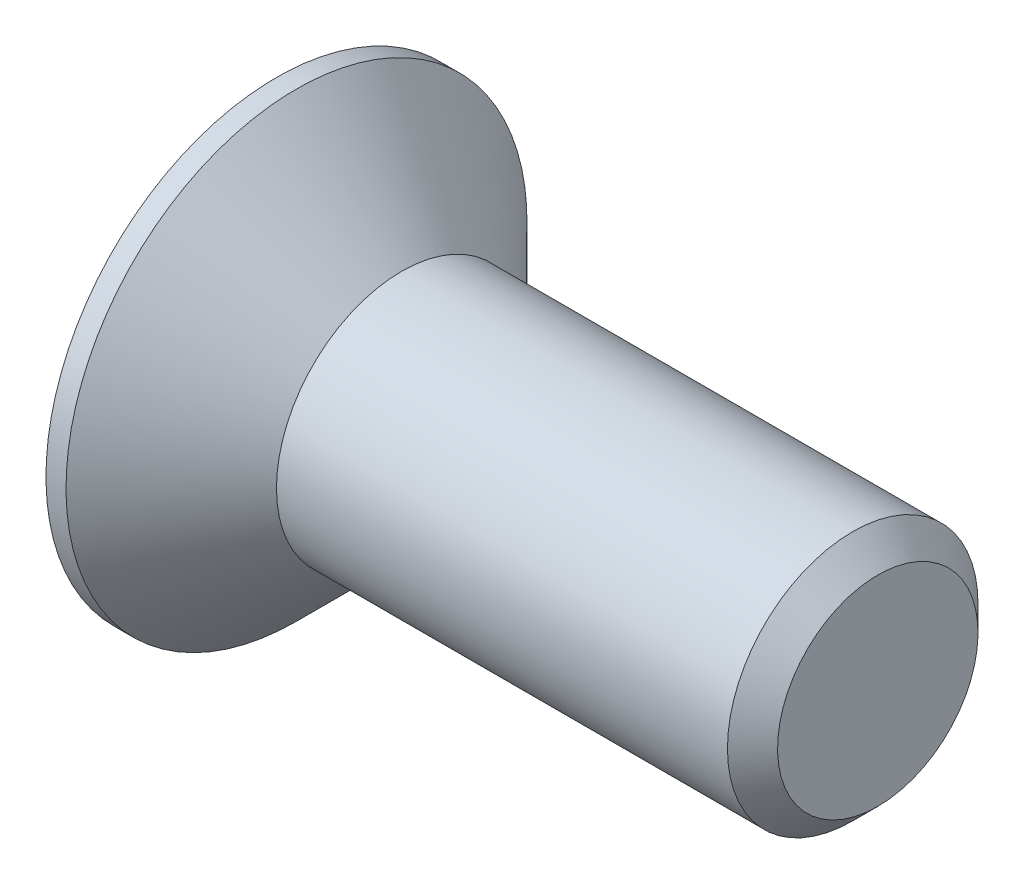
from build123d import *

# Parameters (mm, degrees)
CHAMFER1_SIZE      = 0.5
CUT_EXTRUDE1_DEPTH = 2.1


with BuildPart() as part:
    # Sketch1 → Revolve1 (revolve)
    with BuildSketch(Plane.XY, mode=Mode.PRIVATE) as revolve1_sk:
        Polygon((-2.5, 4.6), (-2.5, 0), (9.5, 0), (9.5, 2.5), (0, 2.5), (-2.1, 4.6), align=None)
    revolve(revolve1_sk.sketch.rotate(Axis((-2.5, 0, 0), (1, 0, 0)), 180), axis=Axis((-2.5, 0, 0), (1, 0, 0)))

    # Chamfer1
    chamfer1_edges = [part.edges().sort_by_distance(p)[0] for p in [
        (9.5, 2.5, 0),
    ]]
    chamfer(chamfer1_edges, length=CHAMFER1_SIZE)

    # Sketch2 → Cut-Extrude1 (cut)
    with BuildSketch(Plane.ZY.offset(2.5)):
        Polygon((-0.575, 2.3), (0.575, 2.3), (0.575, 0.575), (2.3, 0.575), (2.3, -0.575), (0.575, -0.575), (0.575, -2.3), (-0.575, -2.3), (-0.575, -0.575), (-2.3, -0.575), (-2.3, 0.575), (-0.575, 0.575), align=None)
    extrude(amount=-CUT_EXTRUDE1_DEPTH, mode=Mode.SUBTRACT)


solid = part.part
